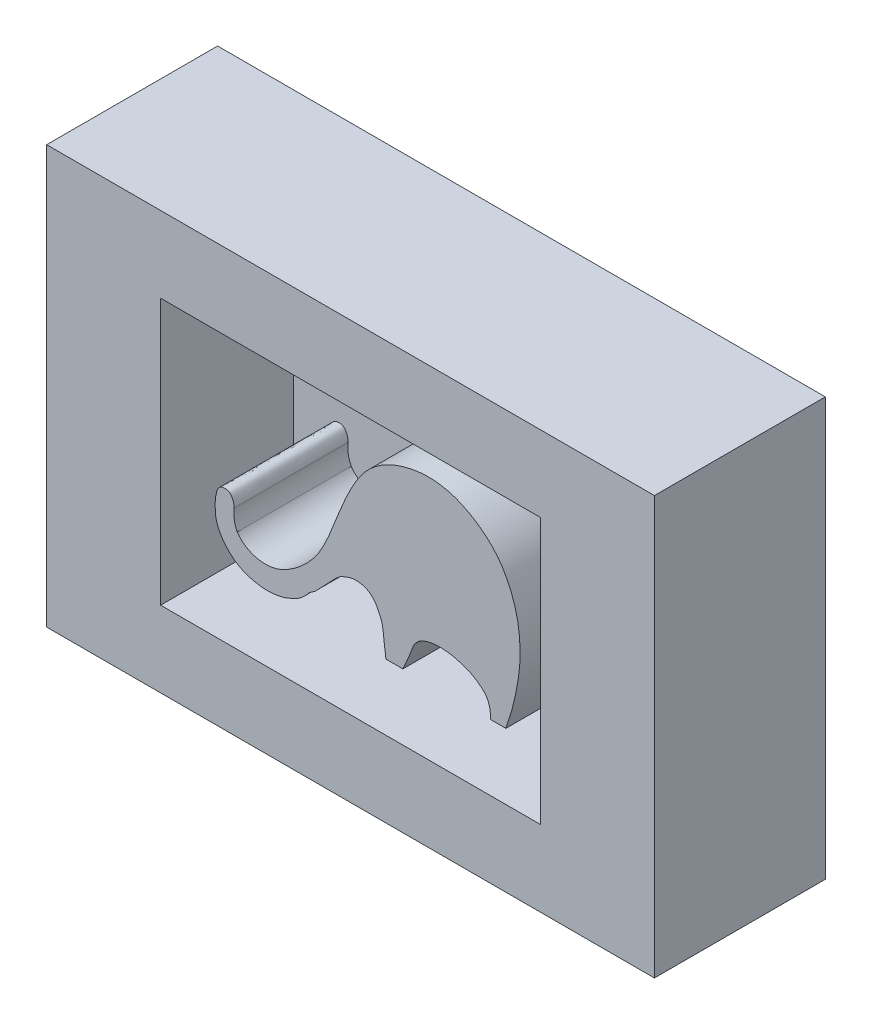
ISO-10303-21;
HEADER;
FILE_DESCRIPTION(('STEP AP214'),'2;1');
FILE_NAME('part.step','',(''),(''),'','','');
FILE_SCHEMA(('AUTOMOTIVE_DESIGN { 1 0 10303 214 1 1 1 1 }'));
ENDSEC;
DATA;
#1=APPLICATION_CONTEXT('core data for automotive mechanical design processes');
#2=APPLICATION_PROTOCOL_DEFINITION('international standard','automotive_design',2000,#1);
#3=PRODUCT_CONTEXT('',#1,'mechanical');
#4=PRODUCT('Part','Part','',(#3));
#5=PRODUCT_RELATED_PRODUCT_CATEGORY('part','',(#4));
#6=PRODUCT_DEFINITION_FORMATION('','',#4);
#7=PRODUCT_DEFINITION_CONTEXT('part definition',#1,'design');
#8=PRODUCT_DEFINITION('design','',#6,#7);
#9=PRODUCT_DEFINITION_SHAPE('','',#8);
#10=(LENGTH_UNIT() NAMED_UNIT(*) SI_UNIT(.MILLI.,.METRE.));
#11=(NAMED_UNIT(*) PLANE_ANGLE_UNIT() SI_UNIT($,.RADIAN.));
#12=(NAMED_UNIT(*) SI_UNIT($,.STERADIAN.) SOLID_ANGLE_UNIT());
#13=UNCERTAINTY_MEASURE_WITH_UNIT(LENGTH_MEASURE(1.E-05),#10,'distance_accuracy_value','');
#14=(GEOMETRIC_REPRESENTATION_CONTEXT(3) GLOBAL_UNCERTAINTY_ASSIGNED_CONTEXT((#13)) GLOBAL_UNIT_ASSIGNED_CONTEXT((#10,
#11,#12)) REPRESENTATION_CONTEXT('',''));
#15=CARTESIAN_POINT('',(0.,0.,0.));
#16=DIRECTION('',(0.,0.,1.));
#17=DIRECTION('',(1.,0.,0.));
#18=AXIS2_PLACEMENT_3D('',#15,#16,#17);
#19=CARTESIAN_POINT('',(0.,0.,9.99999999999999));
#20=DIRECTION('',(0.,0.,-1.));
#21=DIRECTION('',(-1.,0.,0.));
#22=AXIS2_PLACEMENT_3D('',#19,#20,#21);
#23=PLANE('',#22);
#24=DIRECTION('',(0.,1.,0.));
#25=VECTOR('',#24,1.);
#26=CARTESIAN_POINT('',(50.,-35.,9.99999999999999));
#27=LINE('',#26,#25);
#28=CARTESIAN_POINT('',(50.,-35.,9.99999999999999));
#29=VERTEX_POINT('',#28);
#30=CARTESIAN_POINT('',(50.,35.,9.99999999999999));
#31=VERTEX_POINT('',#30);
#32=EDGE_CURVE('E177',#29,#31,#27,.T.);
#33=ORIENTED_EDGE('',*,*,#32,.T.);
#34=DIRECTION('',(-1.,0.,0.));
#35=VECTOR('',#34,1.);
#36=CARTESIAN_POINT('',(-50.,35.,9.99999999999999));
#37=LINE('',#36,#35);
#38=CARTESIAN_POINT('',(-50.,35.,9.99999999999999));
#39=VERTEX_POINT('',#38);
#40=EDGE_CURVE('E180',#31,#39,#37,.T.);
#41=ORIENTED_EDGE('',*,*,#40,.T.);
#42=DIRECTION('',(0.,-1.,0.));
#43=VECTOR('',#42,1.);
#44=CARTESIAN_POINT('',(-50.,-35.,9.99999999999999));
#45=LINE('',#44,#43);
#46=CARTESIAN_POINT('',(-50.,-35.,9.99999999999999));
#47=VERTEX_POINT('',#46);
#48=EDGE_CURVE('E184',#39,#47,#45,.T.);
#49=ORIENTED_EDGE('',*,*,#48,.T.);
#50=DIRECTION('',(1.,0.,0.));
#51=VECTOR('',#50,1.);
#52=CARTESIAN_POINT('',(-50.,-35.,9.99999999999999));
#53=LINE('',#52,#51);
#54=EDGE_CURVE('E187',#47,#29,#53,.T.);
#55=ORIENTED_EDGE('',*,*,#54,.T.);
#56=EDGE_LOOP('',(#33,#41,#49,#55));
#57=FACE_BOUND('',#56,.T.);
#58=CARTESIAN_POINT('',(-34.8252545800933,-13.2227295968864,9.99999999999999));
#59=CARTESIAN_POINT('',(-35.6069413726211,-11.6342772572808,9.99999999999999));
#60=CARTESIAN_POINT('',(-35.8698034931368,-9.93503432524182,9.99999999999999));
#61=CARTESIAN_POINT('',(-35.6138409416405,-8.12500080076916,9.99999999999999));
#62=B_SPLINE_CURVE_WITH_KNOTS('',3,(#58,#59,#60,#61),.UNSPECIFIED.,.F.,.F.,(4,4),
(0.122664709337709,0.566029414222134),.UNSPECIFIED.);
#63=CARTESIAN_POINT('',(-34.8252545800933,-13.2227295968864,9.99999999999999));
#64=VERTEX_POINT('',#63);
#65=CARTESIAN_POINT('',(-35.6138409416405,-8.12500080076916,9.99999999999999));
#66=VERTEX_POINT('',#65);
#67=EDGE_CURVE('E168',#64,#66,#62,.T.);
#68=ORIENTED_EDGE('',*,*,#67,.F.);
#69=CARTESIAN_POINT('',(35.8957458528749,-22.6352268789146,9.99999999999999));
#70=CARTESIAN_POINT('',(36.6368495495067,-20.4079769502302,9.99999999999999));
#71=CARTESIAN_POINT('',(37.9229176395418,-16.5265737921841,9.99999999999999));
#72=CARTESIAN_POINT('',(38.9563024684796,-11.1211026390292,9.99999999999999));
#73=CARTESIAN_POINT('',(39.6893084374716,-6.17493491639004,9.99999999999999));
#74=CARTESIAN_POINT('',(39.6786385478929,-1.60186800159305,9.99999999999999));
#75=CARTESIAN_POINT('',(39.0903081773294,4.05236889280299,9.99999999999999));
#76=CARTESIAN_POINT('',(37.4441834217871,9.37450914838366,9.99999999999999));
#77=CARTESIAN_POINT('',(33.9359579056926,15.7918423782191,9.99999999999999));
#78=CARTESIAN_POINT('',(28.0401296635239,21.1556007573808,9.99999999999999));
#79=CARTESIAN_POINT('',(19.0470165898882,25.0425602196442,9.99999999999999));
#80=CARTESIAN_POINT('',(8.95978672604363,24.2562516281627,9.99999999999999));
#81=CARTESIAN_POINT('',(-0.395722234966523,19.4806970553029,9.99999999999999));
#82=CARTESIAN_POINT('',(-5.96494381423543,10.1931018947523,9.99999999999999));
#83=CARTESIAN_POINT('',(-9.43621996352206,0.919825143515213,9.99999999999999));
#84=CARTESIAN_POINT('',(-13.2098242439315,-7.97413689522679,9.99999999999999));
#85=CARTESIAN_POINT('',(-18.7377315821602,-13.6281424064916,9.99999999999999));
#86=CARTESIAN_POINT('',(-24.7718071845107,-17.0722518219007,9.99999999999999));
#87=CARTESIAN_POINT('',(-30.6265749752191,-16.8623196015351,9.99999999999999));
#88=CARTESIAN_POINT('',(-33.8453408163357,-14.7163227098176,9.99999999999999));
#89=CARTESIAN_POINT('',(-34.8252545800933,-13.2227295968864,9.99999999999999));
#90=B_SPLINE_CURVE_WITH_KNOTS('',3,(#69,#70,#71,#72,#73,#74,#75,#76,#77,#78,#79,#80,#81,#82,#83,
#84,#85,#86,#87,#88,#89),.UNSPECIFIED.,.F.,.F.,(4,1,1,1,1,1,1,1,1,1,1,1,1,1,1,1,1,1,4),
(0.0659112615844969,0.115561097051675,0.152092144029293,0.18209832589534,0.22110546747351,
0.248334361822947,0.302085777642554,0.337487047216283,0.401918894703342,0.466526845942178,
0.539082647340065,0.608583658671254,0.679782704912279,0.760855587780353,0.819739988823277,
0.881556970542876,0.92498383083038,0.96218898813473,1.),.UNSPECIFIED.);
#91=CARTESIAN_POINT('',(35.8957458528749,-22.6352268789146,10.));
#92=VERTEX_POINT('',#91);
#93=EDGE_CURVE('E165',#92,#64,#90,.T.);
#94=ORIENTED_EDGE('',*,*,#93,.F.);
#95=DIRECTION('',(1.,0.,0.));
#96=VECTOR('',#95,1.);
#97=CARTESIAN_POINT('',(35.8957458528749,-22.6352268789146,9.99999999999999));
#98=LINE('',#97,#96);
#99=CARTESIAN_POINT('',(31.7947525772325,-22.6352268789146,9.99999999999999));
#100=VERTEX_POINT('',#99);
#101=EDGE_CURVE('E477',#100,#92,#98,.T.);
#102=ORIENTED_EDGE('',*,*,#101,.F.);
#103=CARTESIAN_POINT('',(8.78074357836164,-22.6352268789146,9.99999999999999));
#104=CARTESIAN_POINT('',(9.06969173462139,-21.9710981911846,9.99999999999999));
#105=CARTESIAN_POINT('',(9.51428766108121,-20.9708557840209,9.99999999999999));
#106=CARTESIAN_POINT('',(10.0886687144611,-19.6408038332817,9.99999999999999));
#107=CARTESIAN_POINT('',(10.8795093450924,-17.9331227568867,9.99999999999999));
#108=CARTESIAN_POINT('',(11.4106972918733,-15.6676004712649,9.99999999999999));
#109=CARTESIAN_POINT('',(13.1420083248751,-13.9880868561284,9.99999999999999));
#110=CARTESIAN_POINT('',(14.921979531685,-13.2455665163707,9.99999999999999));
#111=CARTESIAN_POINT('',(17.2275105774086,-12.7446303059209,9.99999999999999));
#112=CARTESIAN_POINT('',(20.4007251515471,-12.7533727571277,9.99999999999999));
#113=CARTESIAN_POINT('',(23.6100909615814,-13.4861076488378,9.99999999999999));
#114=CARTESIAN_POINT('',(26.4909708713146,-14.4879476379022,9.99999999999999));
#115=CARTESIAN_POINT('',(28.8799307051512,-15.9618061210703,9.99999999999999));
#116=CARTESIAN_POINT('',(31.5549587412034,-18.3228432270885,9.99999999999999));
#117=CARTESIAN_POINT('',(31.9097111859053,-21.1064727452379,9.99999999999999));
#118=CARTESIAN_POINT('',(31.7947525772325,-22.6352268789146,9.99999999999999));
#119=B_SPLINE_CURVE_WITH_KNOTS('',3,(#103,#104,#105,#106,#107,#108,#109,#110,#111,#112,#113,
#114,#115,#116,#117,#118),.UNSPECIFIED.,.F.,.F.,(4,1,1,1,1,1,1,1,1,1,1,1,1,4),(0.,
0.0642524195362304,0.0971507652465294,0.128504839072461,0.231399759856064,0.297965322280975,
0.332509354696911,0.401753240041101,0.505922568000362,0.611055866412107,0.692835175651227,
0.774982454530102,0.859976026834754,1.),.UNSPECIFIED.);
#120=CARTESIAN_POINT('',(8.78074357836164,-22.6352268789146,9.99999999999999));
#121=VERTEX_POINT('',#120);
#122=EDGE_CURVE('E472',#121,#100,#119,.T.);
#123=ORIENTED_EDGE('',*,*,#122,.F.);
#124=DIRECTION('',(1.,0.,0.));
#125=VECTOR('',#124,1.);
#126=CARTESIAN_POINT('',(8.78074357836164,-22.6352268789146,9.99999999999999));
#127=LINE('',#126,#125);
#128=CARTESIAN_POINT('',(4.31274960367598,-22.6352268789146,9.99999999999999));
#129=VERTEX_POINT('',#128);
#130=EDGE_CURVE('E466',#129,#121,#127,.T.);
#131=ORIENTED_EDGE('',*,*,#130,.F.);
#132=CARTESIAN_POINT('',(-17.1134322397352,-18.9279749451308,9.99999999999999));
#133=CARTESIAN_POINT('',(-16.7936045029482,-18.7565682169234,9.99999999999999));
#134=CARTESIAN_POINT('',(-15.8109639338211,-17.2940983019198,9.99999999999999));
#135=CARTESIAN_POINT('',(-14.5887017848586,-16.8319585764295,9.99999999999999));
#136=CARTESIAN_POINT('',(-13.6169213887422,-15.7308251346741,9.99999999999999));
#137=CARTESIAN_POINT('',(-12.8160601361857,-14.9188705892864,9.99999999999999));
#138=CARTESIAN_POINT('',(-11.8331099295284,-13.8675533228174,9.99999999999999));
#139=CARTESIAN_POINT('',(-10.5190472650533,-12.4826511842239,9.99999999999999));
#140=CARTESIAN_POINT('',(-9.32980883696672,-11.2467317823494,9.99999999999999));
#141=CARTESIAN_POINT('',(-8.22836670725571,-10.2182804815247,9.99999999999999));
#142=CARTESIAN_POINT('',(-7.32387493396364,-9.56819392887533,9.99999999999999));
#143=CARTESIAN_POINT('',(-6.28872956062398,-9.2568932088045,9.99999999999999));
#144=CARTESIAN_POINT('',(-5.33294410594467,-8.80053161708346,9.99999999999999));
#145=CARTESIAN_POINT('',(-4.28612684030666,-8.63858756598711,9.99999999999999));
#146=CARTESIAN_POINT('',(-3.02044222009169,-8.57385639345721,9.99999999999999));
#147=CARTESIAN_POINT('',(-1.53428189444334,-8.80356441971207,9.99999999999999));
#148=CARTESIAN_POINT('',(-0.113808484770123,-9.45492471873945,9.99999999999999));
#149=CARTESIAN_POINT('',(0.905921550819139,-10.3775575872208,9.99999999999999));
#150=CARTESIAN_POINT('',(1.73126137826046,-11.3774554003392,9.99999999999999));
#151=CARTESIAN_POINT('',(2.45074835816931,-12.8264869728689,9.99999999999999));
#152=CARTESIAN_POINT('',(3.51304582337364,-15.0268643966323,9.99999999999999));
#153=CARTESIAN_POINT('',(3.71973054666,-18.5033701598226,9.99999999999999));
#154=CARTESIAN_POINT('',(4.15535636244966,-21.1464879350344,9.99999999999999));
#155=CARTESIAN_POINT('',(4.31274960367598,-22.6352268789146,9.99999999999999));
#156=B_SPLINE_CURVE_WITH_KNOTS('',3,(#132,#133,#134,#135,#136,#137,#138,#139,#140,#141,#142,
#143,#144,#145,#146,#147,#148,#149,#150,#151,#152,#153,#154,#155),.UNSPECIFIED.,.F.,.F.,(4,1,1,
1,1,1,1,1,1,1,1,1,1,1,1,1,1,1,1,1,1,4),(0.,0.031125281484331,0.104407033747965,
0.128894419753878,0.15338180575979,0.20247522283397,0.25156863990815,0.316670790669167,
0.348857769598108,0.380530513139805,0.410563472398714,0.440596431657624,0.470558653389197,
0.500209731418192,0.54883903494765,0.597562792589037,0.631216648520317,0.665627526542,
0.707673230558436,0.769118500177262,0.872682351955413,1.),.UNSPECIFIED.);
#157=CARTESIAN_POINT('',(-17.1134322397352,-18.9279749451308,9.99999999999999));
#158=VERTEX_POINT('',#157);
#159=EDGE_CURVE('E458',#158,#129,#156,.T.);
#160=ORIENTED_EDGE('',*,*,#159,.F.);
#161=CARTESIAN_POINT('',(-40.2522537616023,-6.96923324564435,9.99999999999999));
#162=CARTESIAN_POINT('',(-40.3401333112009,-7.28549587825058,9.99999999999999));
#163=CARTESIAN_POINT('',(-40.5463462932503,-7.82524127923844,9.99999999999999));
#164=CARTESIAN_POINT('',(-40.5556901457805,-8.81956980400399,9.99999999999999));
#165=CARTESIAN_POINT('',(-40.7050498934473,-9.70073239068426,9.99999999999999));
#166=CARTESIAN_POINT('',(-40.5931776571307,-10.9394339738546,9.99999999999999));
#167=CARTESIAN_POINT('',(-40.5824770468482,-12.4453311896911,9.99999999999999));
#168=CARTESIAN_POINT('',(-40.0840444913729,-14.2759894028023,9.99999999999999));
#169=CARTESIAN_POINT('',(-39.2294984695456,-15.9504496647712,9.99999999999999));
#170=CARTESIAN_POINT('',(-38.228237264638,-17.4414001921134,9.99999999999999));
#171=CARTESIAN_POINT('',(-37.028952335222,-18.7960650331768,9.99999999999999));
#172=CARTESIAN_POINT('',(-35.6698273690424,-19.9671387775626,9.99999999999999));
#173=CARTESIAN_POINT('',(-34.2074672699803,-20.8747896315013,9.99999999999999));
#174=CARTESIAN_POINT('',(-32.5879489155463,-21.6726544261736,9.99999999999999));
#175=CARTESIAN_POINT('',(-30.2773843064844,-22.2932485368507,9.99999999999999));
#176=CARTESIAN_POINT('',(-27.866345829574,-22.673827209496,9.99999999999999));
#177=CARTESIAN_POINT('',(-25.5578013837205,-22.5962461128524,9.99999999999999));
#178=CARTESIAN_POINT('',(-23.8724650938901,-22.3464935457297,9.99999999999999));
#179=CARTESIAN_POINT('',(-22.4436939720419,-22.0253397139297,9.99999999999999));
#180=CARTESIAN_POINT('',(-21.3303519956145,-21.5486621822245,9.99999999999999));
#181=CARTESIAN_POINT('',(-19.4586097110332,-20.8700078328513,9.99999999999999));
#182=CARTESIAN_POINT('',(-18.0353120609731,-19.9191849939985,9.99999999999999));
#183=CARTESIAN_POINT('',(-17.1134322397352,-18.9279749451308,9.99999999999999));
#184=B_SPLINE_CURVE_WITH_KNOTS('',3,(#161,#162,#163,#164,#165,#166,#167,#168,#169,#170,#171,
#172,#173,#174,#175,#176,#177,#178,#179,#180,#181,#182,#183),.UNSPECIFIED.,.F.,.F.,(4,1,1,1,1,1,
1,1,1,1,1,1,1,1,1,1,1,1,1,1,4),(0.,0.0215459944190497,0.0376986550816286,0.0651010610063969,
0.0801603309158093,0.119497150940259,0.164246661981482,0.203681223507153,0.24319341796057,
0.282443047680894,0.322734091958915,0.361081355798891,0.395761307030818,0.441431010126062,
0.518356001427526,0.555832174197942,0.593351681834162,0.630762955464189,0.651949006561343,
0.673135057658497,0.762140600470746),.UNSPECIFIED.);
#185=CARTESIAN_POINT('',(-40.2522537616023,-6.96923324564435,9.99999999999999));
#186=VERTEX_POINT('',#185);
#187=EDGE_CURVE('E55',#186,#158,#184,.T.);
#188=ORIENTED_EDGE('',*,*,#187,.F.);
#189=CARTESIAN_POINT('',(-35.6138409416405,-8.12500080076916,9.99999999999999));
#190=CARTESIAN_POINT('',(-35.6545348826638,-7.30153427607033,9.99999999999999));
#191=CARTESIAN_POINT('',(-35.9354173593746,-6.20842070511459,9.99999999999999));
#192=CARTESIAN_POINT('',(-36.90542709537,-5.03371175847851,9.99999999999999));
#193=CARTESIAN_POINT('',(-38.0249863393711,-4.84827722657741,9.99999999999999));
#194=CARTESIAN_POINT('',(-39.5501952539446,-5.06113820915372,9.99999999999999));
#195=CARTESIAN_POINT('',(-40.2328273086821,-6.27105146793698,9.99999999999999));
#196=CARTESIAN_POINT('',(-40.2522537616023,-6.96923324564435,9.99999999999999));
#197=B_SPLINE_CURVE_WITH_KNOTS('',3,(#189,#190,#191,#192,#193,#194,#195,#196),.UNSPECIFIED.,.F.,
.F.,(4,1,1,1,1,4),(0.,0.306186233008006,0.439361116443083,0.549535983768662,0.727048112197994,
1.),.UNSPECIFIED.);
#198=EDGE_CURVE('E50',#66,#186,#197,.T.);
#199=ORIENTED_EDGE('',*,*,#198,.F.);
#200=EDGE_LOOP('',(#68,#94,#102,#123,#131,#160,#188,#199));
#201=FACE_BOUND('',#200,.T.);
#202=ADVANCED_FACE('F35',(#57,#201),#23,.F.);
#203=CARTESIAN_POINT('',(80.,-55.,45.));
#204=DIRECTION('',(-1.,0.,0.));
#205=DIRECTION('',(0.,0.,1.));
#206=AXIS2_PLACEMENT_3D('',#203,#204,#205);
#207=PLANE('',#206);
#208=DIRECTION('',(0.,1.,0.));
#209=VECTOR('',#208,1.);
#210=CARTESIAN_POINT('',(80.,-55.,0.));
#211=LINE('',#210,#209);
#212=CARTESIAN_POINT('',(80.,-55.,0.));
#213=VERTEX_POINT('',#212);
#214=CARTESIAN_POINT('',(80.,55.,0.));
#215=VERTEX_POINT('',#214);
#216=EDGE_CURVE('E200',#213,#215,#211,.T.);
#217=ORIENTED_EDGE('',*,*,#216,.T.);
#218=DIRECTION('',(0.,0.,-1.));
#219=VECTOR('',#218,1.);
#220=CARTESIAN_POINT('',(80.,55.,45.));
#221=LINE('',#220,#219);
#222=CARTESIAN_POINT('',(80.,55.,45.));
#223=VERTEX_POINT('',#222);
#224=EDGE_CURVE('E11',#223,#215,#221,.T.);
#225=ORIENTED_EDGE('',*,*,#224,.F.);
#226=DIRECTION('',(0.,1.,0.));
#227=VECTOR('',#226,1.);
#228=CARTESIAN_POINT('',(80.,-55.,45.));
#229=LINE('',#228,#227);
#230=CARTESIAN_POINT('',(80.,-55.,45.));
#231=VERTEX_POINT('',#230);
#232=EDGE_CURVE('E207',#231,#223,#229,.T.);
#233=ORIENTED_EDGE('',*,*,#232,.F.);
#234=DIRECTION('',(0.,0.,-1.));
#235=VECTOR('',#234,1.);
#236=CARTESIAN_POINT('',(80.,-55.,45.));
#237=LINE('',#236,#235);
#238=EDGE_CURVE('E217',#231,#213,#237,.T.);
#239=ORIENTED_EDGE('',*,*,#238,.T.);
#240=EDGE_LOOP('',(#217,#225,#233,#239));
#241=FACE_BOUND('',#240,.T.);
#242=ADVANCED_FACE('F37',(#241),#207,.F.);
#243=CARTESIAN_POINT('',(-80.,55.,45.));
#244=DIRECTION('',(0.,-1.,0.));
#245=DIRECTION('',(0.,0.,-1.));
#246=AXIS2_PLACEMENT_3D('',#243,#244,#245);
#247=PLANE('',#246);
#248=DIRECTION('',(-1.,0.,0.));
#249=VECTOR('',#248,1.);
#250=CARTESIAN_POINT('',(-80.,55.,0.));
#251=LINE('',#250,#249);
#252=CARTESIAN_POINT('',(-80.,55.,0.));
#253=VERTEX_POINT('',#252);
#254=EDGE_CURVE('E220',#215,#253,#251,.T.);
#255=ORIENTED_EDGE('',*,*,#254,.T.);
#256=DIRECTION('',(0.,0.,-1.));
#257=VECTOR('',#256,1.);
#258=CARTESIAN_POINT('',(-80.,55.,45.));
#259=LINE('',#258,#257);
#260=CARTESIAN_POINT('',(-80.,55.,45.));
#261=VERTEX_POINT('',#260);
#262=EDGE_CURVE('E43',#261,#253,#259,.T.);
#263=ORIENTED_EDGE('',*,*,#262,.F.);
#264=DIRECTION('',(-1.,0.,0.));
#265=VECTOR('',#264,1.);
#266=CARTESIAN_POINT('',(-80.,55.,45.));
#267=LINE('',#266,#265);
#268=EDGE_CURVE('E210',#223,#261,#267,.T.);
#269=ORIENTED_EDGE('',*,*,#268,.F.);
#270=ORIENTED_EDGE('',*,*,#224,.T.);
#271=EDGE_LOOP('',(#255,#263,#269,#270));
#272=FACE_BOUND('',#271,.T.);
#273=ADVANCED_FACE('F250',(#272),#247,.F.);
#274=CARTESIAN_POINT('',(-80.,-55.,45.));
#275=DIRECTION('',(1.,0.,0.));
#276=DIRECTION('',(0.,0.,-1.));
#277=AXIS2_PLACEMENT_3D('',#274,#275,#276);
#278=PLANE('',#277);
#279=DIRECTION('',(0.,-1.,0.));
#280=VECTOR('',#279,1.);
#281=CARTESIAN_POINT('',(-80.,-55.,0.));
#282=LINE('',#281,#280);
#283=CARTESIAN_POINT('',(-80.,-55.,0.));
#284=VERTEX_POINT('',#283);
#285=EDGE_CURVE('E222',#253,#284,#282,.T.);
#286=ORIENTED_EDGE('',*,*,#285,.T.);
#287=DIRECTION('',(0.,0.,-1.));
#288=VECTOR('',#287,1.);
#289=CARTESIAN_POINT('',(-80.,-55.,45.));
#290=LINE('',#289,#288);
#291=CARTESIAN_POINT('',(-80.,-55.,45.));
#292=VERTEX_POINT('',#291);
#293=EDGE_CURVE('E227',#292,#284,#290,.T.);
#294=ORIENTED_EDGE('',*,*,#293,.F.);
#295=DIRECTION('',(0.,-1.,0.));
#296=VECTOR('',#295,1.);
#297=CARTESIAN_POINT('',(-80.,-55.,45.));
#298=LINE('',#297,#296);
#299=EDGE_CURVE('E213',#261,#292,#298,.T.);
#300=ORIENTED_EDGE('',*,*,#299,.F.);
#301=ORIENTED_EDGE('',*,*,#262,.T.);
#302=EDGE_LOOP('',(#286,#294,#300,#301));
#303=FACE_BOUND('',#302,.T.);
#304=ADVANCED_FACE('F234',(#303),#278,.F.);
#305=CARTESIAN_POINT('',(-80.,-55.,45.));
#306=DIRECTION('',(0.,1.,0.));
#307=DIRECTION('',(0.,0.,1.));
#308=AXIS2_PLACEMENT_3D('',#305,#306,#307);
#309=PLANE('',#308);
#310=DIRECTION('',(1.,0.,0.));
#311=VECTOR('',#310,1.);
#312=CARTESIAN_POINT('',(-80.,-55.,0.));
#313=LINE('',#312,#311);
#314=EDGE_CURVE('E211',#284,#213,#313,.T.);
#315=ORIENTED_EDGE('',*,*,#314,.T.);
#316=ORIENTED_EDGE('',*,*,#238,.F.);
#317=DIRECTION('',(1.,0.,0.));
#318=VECTOR('',#317,1.);
#319=CARTESIAN_POINT('',(-80.,-55.,45.));
#320=LINE('',#319,#318);
#321=EDGE_CURVE('E215',#292,#231,#320,.T.);
#322=ORIENTED_EDGE('',*,*,#321,.F.);
#323=ORIENTED_EDGE('',*,*,#293,.T.);
#324=EDGE_LOOP('',(#315,#316,#322,#323));
#325=FACE_BOUND('',#324,.T.);
#326=ADVANCED_FACE('F243',(#325),#309,.F.);
#327=CARTESIAN_POINT('',(0.,0.,45.));
#328=DIRECTION('',(0.,0.,-1.));
#329=DIRECTION('',(-1.,0.,0.));
#330=AXIS2_PLACEMENT_3D('',#327,#328,#329);
#331=PLANE('',#330);
#332=DIRECTION('',(-1.,0.,0.));
#333=VECTOR('',#332,1.);
#334=CARTESIAN_POINT('',(-50.,35.,45.));
#335=LINE('',#334,#333);
#336=CARTESIAN_POINT('',(50.,35.,45.));
#337=VERTEX_POINT('',#336);
#338=CARTESIAN_POINT('',(-50.,35.,45.));
#339=VERTEX_POINT('',#338);
#340=EDGE_CURVE('E171',#337,#339,#335,.T.);
#341=ORIENTED_EDGE('',*,*,#340,.F.);
#342=DIRECTION('',(0.,1.,0.));
#343=VECTOR('',#342,1.);
#344=CARTESIAN_POINT('',(50.,-35.,45.));
#345=LINE('',#344,#343);
#346=CARTESIAN_POINT('',(50.,-35.,45.));
#347=VERTEX_POINT('',#346);
#348=EDGE_CURVE('E169',#347,#337,#345,.T.);
#349=ORIENTED_EDGE('',*,*,#348,.F.);
#350=DIRECTION('',(1.,0.,0.));
#351=VECTOR('',#350,1.);
#352=CARTESIAN_POINT('',(-50.,-35.,45.));
#353=LINE('',#352,#351);
#354=CARTESIAN_POINT('',(-50.,-35.,45.));
#355=VERTEX_POINT('',#354);
#356=EDGE_CURVE('E181',#355,#347,#353,.T.);
#357=ORIENTED_EDGE('',*,*,#356,.F.);
#358=DIRECTION('',(0.,-1.,0.));
#359=VECTOR('',#358,1.);
#360=CARTESIAN_POINT('',(-50.,-35.,45.));
#361=LINE('',#360,#359);
#362=EDGE_CURVE('E193',#339,#355,#361,.T.);
#363=ORIENTED_EDGE('',*,*,#362,.F.);
#364=EDGE_LOOP('',(#341,#349,#357,#363));
#365=FACE_BOUND('',#364,.T.);
#366=ORIENTED_EDGE('',*,*,#232,.T.);
#367=ORIENTED_EDGE('',*,*,#268,.T.);
#368=ORIENTED_EDGE('',*,*,#299,.T.);
#369=ORIENTED_EDGE('',*,*,#321,.T.);
#370=EDGE_LOOP('',(#366,#367,#368,#369));
#371=FACE_BOUND('',#370,.T.);
#372=ADVANCED_FACE('F249',(#365,#371),#331,.F.);
#373=CARTESIAN_POINT('',(0.,0.,0.));
#374=DIRECTION('',(0.,0.,-1.));
#375=DIRECTION('',(-1.,0.,0.));
#376=AXIS2_PLACEMENT_3D('',#373,#374,#375);
#377=PLANE('',#376);
#378=ORIENTED_EDGE('',*,*,#216,.F.);
#379=ORIENTED_EDGE('',*,*,#314,.F.);
#380=ORIENTED_EDGE('',*,*,#285,.F.);
#381=ORIENTED_EDGE('',*,*,#254,.F.);
#382=EDGE_LOOP('',(#378,#379,#380,#381));
#383=FACE_BOUND('',#382,.T.);
#384=ADVANCED_FACE('F240',(#383),#377,.T.);
#385=CARTESIAN_POINT('',(50.,-35.,9.99999999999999));
#386=DIRECTION('',(1.,0.,0.));
#387=DIRECTION('',(0.,0.,-1.));
#388=AXIS2_PLACEMENT_3D('',#385,#386,#387);
#389=PLANE('',#388);
#390=ORIENTED_EDGE('',*,*,#348,.T.);
#391=DIRECTION('',(0.,0.,1.));
#392=VECTOR('',#391,1.);
#393=CARTESIAN_POINT('',(50.,35.,9.99999999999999));
#394=LINE('',#393,#392);
#395=EDGE_CURVE('E189',#31,#337,#394,.T.);
#396=ORIENTED_EDGE('',*,*,#395,.F.);
#397=ORIENTED_EDGE('',*,*,#32,.F.);
#398=DIRECTION('',(0.,0.,1.));
#399=VECTOR('',#398,1.);
#400=CARTESIAN_POINT('',(50.,-35.,9.99999999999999));
#401=LINE('',#400,#399);
#402=EDGE_CURVE('E198',#29,#347,#401,.T.);
#403=ORIENTED_EDGE('',*,*,#402,.T.);
#404=EDGE_LOOP('',(#390,#396,#397,#403));
#405=FACE_BOUND('',#404,.T.);
#406=ADVANCED_FACE('F269',(#405),#389,.F.);
#407=CARTESIAN_POINT('',(-50.,-35.,9.99999999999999));
#408=DIRECTION('',(0.,-1.,0.));
#409=DIRECTION('',(0.,0.,-1.));
#410=AXIS2_PLACEMENT_3D('',#407,#408,#409);
#411=PLANE('',#410);
#412=ORIENTED_EDGE('',*,*,#356,.T.);
#413=ORIENTED_EDGE('',*,*,#402,.F.);
#414=ORIENTED_EDGE('',*,*,#54,.F.);
#415=DIRECTION('',(0.,0.,1.));
#416=VECTOR('',#415,1.);
#417=CARTESIAN_POINT('',(-50.,-35.,9.99999999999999));
#418=LINE('',#417,#416);
#419=EDGE_CURVE('E201',#47,#355,#418,.T.);
#420=ORIENTED_EDGE('',*,*,#419,.T.);
#421=EDGE_LOOP('',(#412,#413,#414,#420));
#422=FACE_BOUND('',#421,.T.);
#423=ADVANCED_FACE('F265',(#422),#411,.F.);
#424=CARTESIAN_POINT('',(-50.,-35.,9.99999999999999));
#425=DIRECTION('',(-1.,0.,0.));
#426=DIRECTION('',(0.,0.,1.));
#427=AXIS2_PLACEMENT_3D('',#424,#425,#426);
#428=PLANE('',#427);
#429=ORIENTED_EDGE('',*,*,#362,.T.);
#430=ORIENTED_EDGE('',*,*,#419,.F.);
#431=ORIENTED_EDGE('',*,*,#48,.F.);
#432=DIRECTION('',(0.,0.,1.));
#433=VECTOR('',#432,1.);
#434=CARTESIAN_POINT('',(-50.,35.,9.99999999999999));
#435=LINE('',#434,#433);
#436=EDGE_CURVE('E203',#39,#339,#435,.T.);
#437=ORIENTED_EDGE('',*,*,#436,.T.);
#438=EDGE_LOOP('',(#429,#430,#431,#437));
#439=FACE_BOUND('',#438,.T.);
#440=ADVANCED_FACE('F268',(#439),#428,.F.);
#441=CARTESIAN_POINT('',(-50.,35.,9.99999999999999));
#442=DIRECTION('',(0.,1.,0.));
#443=DIRECTION('',(0.,0.,1.));
#444=AXIS2_PLACEMENT_3D('',#441,#442,#443);
#445=PLANE('',#444);
#446=ORIENTED_EDGE('',*,*,#340,.T.);
#447=ORIENTED_EDGE('',*,*,#436,.F.);
#448=ORIENTED_EDGE('',*,*,#40,.F.);
#449=ORIENTED_EDGE('',*,*,#395,.T.);
#450=EDGE_LOOP('',(#446,#447,#448,#449));
#451=FACE_BOUND('',#450,.T.);
#452=ADVANCED_FACE('F273',(#451),#445,.F.);
#453=CARTESIAN_POINT('',(-34.8252545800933,-13.2227295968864,40.));
#454=CARTESIAN_POINT('',(-35.6069413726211,-11.6342772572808,40.));
#455=CARTESIAN_POINT('',(-35.8698034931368,-9.93503432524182,40.));
#456=CARTESIAN_POINT('',(-35.6138409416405,-8.12500080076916,40.));
#457=B_SPLINE_CURVE_WITH_KNOTS('',3,(#453,#454,#455,#456),.UNSPECIFIED.,.F.,.F.,(4,4),
(0.122664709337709,0.566029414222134),.UNSPECIFIED.);
#458=DIRECTION('',(0.,0.,-1.));
#459=VECTOR('',#458,1.);
#460=SURFACE_OF_LINEAR_EXTRUSION('',#457,#459);
#461=ORIENTED_EDGE('',*,*,#67,.T.);
#462=DIRECTION('',(0.,0.,-1.));
#463=VECTOR('',#462,1.);
#464=CARTESIAN_POINT('',(-35.6138409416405,-8.12500080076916,40.));
#465=LINE('',#464,#463);
#466=CARTESIAN_POINT('',(-35.6138409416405,-8.12500080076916,40.));
#467=VERTEX_POINT('',#466);
#468=EDGE_CURVE('E149',#467,#66,#465,.T.);
#469=ORIENTED_EDGE('',*,*,#468,.F.);
#470=CARTESIAN_POINT('',(-34.8252545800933,-13.2227295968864,40.));
#471=VERTEX_POINT('',#470);
#472=EDGE_CURVE('E156',#471,#467,#457,.T.);
#473=ORIENTED_EDGE('',*,*,#472,.F.);
#474=DIRECTION('',(0.,0.,-1.));
#475=VECTOR('',#474,1.);
#476=CARTESIAN_POINT('',(-34.8252545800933,-13.2227295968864,40.));
#477=LINE('',#476,#475);
#478=EDGE_CURVE('E437',#471,#64,#477,.T.);
#479=ORIENTED_EDGE('',*,*,#478,.T.);
#480=EDGE_LOOP('',(#461,#469,#473,#479));
#481=FACE_BOUND('',#480,.T.);
#482=ADVANCED_FACE('F167',(#481),#460,.F.);
#483=CARTESIAN_POINT('',(-35.6138409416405,-8.12500080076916,40.));
#484=CARTESIAN_POINT('',(-35.6545348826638,-7.30153427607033,40.));
#485=CARTESIAN_POINT('',(-35.9354173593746,-6.20842070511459,40.));
#486=CARTESIAN_POINT('',(-36.90542709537,-5.03371175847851,40.));
#487=CARTESIAN_POINT('',(-38.0249863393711,-4.84827722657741,40.));
#488=CARTESIAN_POINT('',(-39.5501952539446,-5.06113820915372,40.));
#489=CARTESIAN_POINT('',(-40.2328273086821,-6.27105146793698,40.));
#490=CARTESIAN_POINT('',(-40.2522537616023,-6.96923324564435,40.));
#491=B_SPLINE_CURVE_WITH_KNOTS('',3,(#483,#484,#485,#486,#487,#488,#489,#490),.UNSPECIFIED.,.F.,
.F.,(4,1,1,1,1,4),(0.,0.306186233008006,0.439361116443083,0.549535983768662,0.727048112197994,
1.),.UNSPECIFIED.);
#492=DIRECTION('',(0.,0.,-1.));
#493=VECTOR('',#492,1.);
#494=SURFACE_OF_LINEAR_EXTRUSION('',#491,#493);
#495=ORIENTED_EDGE('',*,*,#198,.T.);
#496=DIRECTION('',(0.,0.,-1.));
#497=VECTOR('',#496,1.);
#498=CARTESIAN_POINT('',(-40.2522537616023,-6.96923324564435,40.));
#499=LINE('',#498,#497);
#500=CARTESIAN_POINT('',(-40.2522537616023,-6.96923324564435,40.));
#501=VERTEX_POINT('',#500);
#502=EDGE_CURVE('E152',#501,#186,#499,.T.);
#503=ORIENTED_EDGE('',*,*,#502,.F.);
#504=EDGE_CURVE('E145',#467,#501,#491,.T.);
#505=ORIENTED_EDGE('',*,*,#504,.F.);
#506=ORIENTED_EDGE('',*,*,#468,.T.);
#507=EDGE_LOOP('',(#495,#503,#505,#506));
#508=FACE_BOUND('',#507,.T.);
#509=ADVANCED_FACE('F147',(#508),#494,.F.);
#510=CARTESIAN_POINT('',(-40.2522537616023,-6.96923324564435,40.));
#511=CARTESIAN_POINT('',(-40.3401333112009,-7.28549587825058,40.));
#512=CARTESIAN_POINT('',(-40.5463462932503,-7.82524127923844,40.));
#513=CARTESIAN_POINT('',(-40.5556901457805,-8.81956980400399,40.));
#514=CARTESIAN_POINT('',(-40.7050498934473,-9.70073239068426,40.));
#515=CARTESIAN_POINT('',(-40.5931776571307,-10.9394339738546,40.));
#516=CARTESIAN_POINT('',(-40.5824770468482,-12.4453311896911,40.));
#517=CARTESIAN_POINT('',(-40.0840444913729,-14.2759894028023,40.));
#518=CARTESIAN_POINT('',(-39.2294984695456,-15.9504496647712,40.));
#519=CARTESIAN_POINT('',(-38.228237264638,-17.4414001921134,40.));
#520=CARTESIAN_POINT('',(-37.028952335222,-18.7960650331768,40.));
#521=CARTESIAN_POINT('',(-35.6698273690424,-19.9671387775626,40.));
#522=CARTESIAN_POINT('',(-34.2074672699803,-20.8747896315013,40.));
#523=CARTESIAN_POINT('',(-32.5879489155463,-21.6726544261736,40.));
#524=CARTESIAN_POINT('',(-30.2773843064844,-22.2932485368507,40.));
#525=CARTESIAN_POINT('',(-27.866345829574,-22.673827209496,40.));
#526=CARTESIAN_POINT('',(-25.5578013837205,-22.5962461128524,40.));
#527=CARTESIAN_POINT('',(-23.8724650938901,-22.3464935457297,40.));
#528=CARTESIAN_POINT('',(-22.4436939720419,-22.0253397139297,40.));
#529=CARTESIAN_POINT('',(-21.3303519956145,-21.5486621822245,40.));
#530=CARTESIAN_POINT('',(-19.4586097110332,-20.8700078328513,40.));
#531=CARTESIAN_POINT('',(-18.0353120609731,-19.9191849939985,40.));
#532=CARTESIAN_POINT('',(-17.1134322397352,-18.9279749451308,40.));
#533=B_SPLINE_CURVE_WITH_KNOTS('',3,(#510,#511,#512,#513,#514,#515,#516,#517,#518,#519,#520,
#521,#522,#523,#524,#525,#526,#527,#528,#529,#530,#531,#532),.UNSPECIFIED.,.F.,.F.,(4,1,1,1,1,1,
1,1,1,1,1,1,1,1,1,1,1,1,1,1,4),(0.,0.0215459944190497,0.0376986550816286,0.0651010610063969,
0.0801603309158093,0.119497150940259,0.164246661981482,0.203681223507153,0.24319341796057,
0.282443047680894,0.322734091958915,0.361081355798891,0.395761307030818,0.441431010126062,
0.518356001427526,0.555832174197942,0.593351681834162,0.630762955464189,0.651949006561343,
0.673135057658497,0.762140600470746),.UNSPECIFIED.);
#534=DIRECTION('',(0.,0.,-1.));
#535=VECTOR('',#534,1.);
#536=SURFACE_OF_LINEAR_EXTRUSION('',#533,#535);
#537=ORIENTED_EDGE('',*,*,#187,.T.);
#538=DIRECTION('',(0.,0.,-1.));
#539=VECTOR('',#538,1.);
#540=CARTESIAN_POINT('',(-17.1134322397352,-18.9279749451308,40.));
#541=LINE('',#540,#539);
#542=CARTESIAN_POINT('',(-17.1134322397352,-18.9279749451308,40.));
#543=VERTEX_POINT('',#542);
#544=EDGE_CURVE('E173',#543,#158,#541,.T.);
#545=ORIENTED_EDGE('',*,*,#544,.F.);
#546=EDGE_CURVE('E155',#501,#543,#533,.T.);
#547=ORIENTED_EDGE('',*,*,#546,.F.);
#548=ORIENTED_EDGE('',*,*,#502,.T.);
#549=EDGE_LOOP('',(#537,#545,#547,#548));
#550=FACE_BOUND('',#549,.T.);
#551=ADVANCED_FACE('F326',(#550),#536,.F.);
#552=CARTESIAN_POINT('',(-17.1134322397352,-18.9279749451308,40.));
#553=CARTESIAN_POINT('',(-16.7936045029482,-18.7565682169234,40.));
#554=CARTESIAN_POINT('',(-15.8109639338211,-17.2940983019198,40.));
#555=CARTESIAN_POINT('',(-14.5887017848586,-16.8319585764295,40.));
#556=CARTESIAN_POINT('',(-13.6169213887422,-15.7308251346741,40.));
#557=CARTESIAN_POINT('',(-12.8160601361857,-14.9188705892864,40.));
#558=CARTESIAN_POINT('',(-11.8331099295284,-13.8675533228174,40.));
#559=CARTESIAN_POINT('',(-10.5190472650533,-12.4826511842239,40.));
#560=CARTESIAN_POINT('',(-9.32980883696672,-11.2467317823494,40.));
#561=CARTESIAN_POINT('',(-8.22836670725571,-10.2182804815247,40.));
#562=CARTESIAN_POINT('',(-7.32387493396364,-9.56819392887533,40.));
#563=CARTESIAN_POINT('',(-6.28872956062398,-9.2568932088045,40.));
#564=CARTESIAN_POINT('',(-5.33294410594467,-8.80053161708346,40.));
#565=CARTESIAN_POINT('',(-4.28612684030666,-8.63858756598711,40.));
#566=CARTESIAN_POINT('',(-3.02044222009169,-8.57385639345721,40.));
#567=CARTESIAN_POINT('',(-1.53428189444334,-8.80356441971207,40.));
#568=CARTESIAN_POINT('',(-0.113808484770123,-9.45492471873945,40.));
#569=CARTESIAN_POINT('',(0.905921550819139,-10.3775575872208,40.));
#570=CARTESIAN_POINT('',(1.73126137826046,-11.3774554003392,40.));
#571=CARTESIAN_POINT('',(2.45074835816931,-12.8264869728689,40.));
#572=CARTESIAN_POINT('',(3.51304582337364,-15.0268643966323,40.));
#573=CARTESIAN_POINT('',(3.71973054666,-18.5033701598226,40.));
#574=CARTESIAN_POINT('',(4.15535636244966,-21.1464879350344,40.));
#575=CARTESIAN_POINT('',(4.31274960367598,-22.6352268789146,40.));
#576=B_SPLINE_CURVE_WITH_KNOTS('',3,(#552,#553,#554,#555,#556,#557,#558,#559,#560,#561,#562,
#563,#564,#565,#566,#567,#568,#569,#570,#571,#572,#573,#574,#575),.UNSPECIFIED.,.F.,.F.,(4,1,1,
1,1,1,1,1,1,1,1,1,1,1,1,1,1,1,1,1,1,4),(0.,0.031125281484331,0.104407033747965,
0.128894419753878,0.15338180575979,0.20247522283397,0.25156863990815,0.316670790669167,
0.348857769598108,0.380530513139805,0.410563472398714,0.440596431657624,0.470558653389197,
0.500209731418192,0.54883903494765,0.597562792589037,0.631216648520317,0.665627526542,
0.707673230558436,0.769118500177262,0.872682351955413,1.),.UNSPECIFIED.);
#577=DIRECTION('',(0.,0.,-1.));
#578=VECTOR('',#577,1.);
#579=SURFACE_OF_LINEAR_EXTRUSION('',#576,#578);
#580=ORIENTED_EDGE('',*,*,#159,.T.);
#581=DIRECTION('',(0.,0.,-1.));
#582=VECTOR('',#581,1.);
#583=CARTESIAN_POINT('',(4.31274960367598,-22.6352268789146,40.));
#584=LINE('',#583,#582);
#585=CARTESIAN_POINT('',(4.31274960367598,-22.6352268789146,40.));
#586=VERTEX_POINT('',#585);
#587=EDGE_CURVE('E500',#586,#129,#584,.T.);
#588=ORIENTED_EDGE('',*,*,#587,.F.);
#589=EDGE_CURVE('E506',#543,#586,#576,.T.);
#590=ORIENTED_EDGE('',*,*,#589,.F.);
#591=ORIENTED_EDGE('',*,*,#544,.T.);
#592=EDGE_LOOP('',(#580,#588,#590,#591));
#593=FACE_BOUND('',#592,.T.);
#594=ADVANCED_FACE('F332',(#593),#579,.F.);
#595=CARTESIAN_POINT('',(8.78074357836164,-22.6352268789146,40.));
#596=DIRECTION('',(0.,1.,0.));
#597=DIRECTION('',(0.,0.,1.));
#598=AXIS2_PLACEMENT_3D('',#595,#596,#597);
#599=PLANE('',#598);
#600=ORIENTED_EDGE('',*,*,#130,.T.);
#601=DIRECTION('',(0.,0.,-1.));
#602=VECTOR('',#601,1.);
#603=CARTESIAN_POINT('',(8.78074357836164,-22.6352268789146,40.));
#604=LINE('',#603,#602);
#605=CARTESIAN_POINT('',(8.78074357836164,-22.6352268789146,40.));
#606=VERTEX_POINT('',#605);
#607=EDGE_CURVE('E497',#606,#121,#604,.T.);
#608=ORIENTED_EDGE('',*,*,#607,.F.);
#609=DIRECTION('',(1.,0.,0.));
#610=VECTOR('',#609,1.);
#611=CARTESIAN_POINT('',(8.78074357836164,-22.6352268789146,40.));
#612=LINE('',#611,#610);
#613=EDGE_CURVE('E508',#586,#606,#612,.T.);
#614=ORIENTED_EDGE('',*,*,#613,.F.);
#615=ORIENTED_EDGE('',*,*,#587,.T.);
#616=EDGE_LOOP('',(#600,#608,#614,#615));
#617=FACE_BOUND('',#616,.T.);
#618=ADVANCED_FACE('F340',(#617),#599,.F.);
#619=CARTESIAN_POINT('',(8.78074357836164,-22.6352268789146,40.));
#620=CARTESIAN_POINT('',(9.06969173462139,-21.9710981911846,40.));
#621=CARTESIAN_POINT('',(9.51428766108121,-20.9708557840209,40.));
#622=CARTESIAN_POINT('',(10.0886687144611,-19.6408038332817,40.));
#623=CARTESIAN_POINT('',(10.8795093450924,-17.9331227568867,40.));
#624=CARTESIAN_POINT('',(11.4106972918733,-15.6676004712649,40.));
#625=CARTESIAN_POINT('',(13.1420083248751,-13.9880868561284,40.));
#626=CARTESIAN_POINT('',(14.921979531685,-13.2455665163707,40.));
#627=CARTESIAN_POINT('',(17.2275105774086,-12.7446303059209,40.));
#628=CARTESIAN_POINT('',(20.4007251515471,-12.7533727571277,40.));
#629=CARTESIAN_POINT('',(23.6100909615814,-13.4861076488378,40.));
#630=CARTESIAN_POINT('',(26.4909708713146,-14.4879476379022,40.));
#631=CARTESIAN_POINT('',(28.8799307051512,-15.9618061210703,40.));
#632=CARTESIAN_POINT('',(31.5549587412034,-18.3228432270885,40.));
#633=CARTESIAN_POINT('',(31.9097111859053,-21.1064727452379,40.));
#634=CARTESIAN_POINT('',(31.7947525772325,-22.6352268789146,40.));
#635=B_SPLINE_CURVE_WITH_KNOTS('',3,(#619,#620,#621,#622,#623,#624,#625,#626,#627,#628,#629,
#630,#631,#632,#633,#634),.UNSPECIFIED.,.F.,.F.,(4,1,1,1,1,1,1,1,1,1,1,1,1,4),(0.,
0.0642524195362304,0.0971507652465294,0.128504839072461,0.231399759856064,0.297965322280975,
0.332509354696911,0.401753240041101,0.505922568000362,0.611055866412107,0.692835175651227,
0.774982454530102,0.859976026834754,1.),.UNSPECIFIED.);
#636=DIRECTION('',(0.,0.,-1.));
#637=VECTOR('',#636,1.);
#638=SURFACE_OF_LINEAR_EXTRUSION('',#635,#637);
#639=ORIENTED_EDGE('',*,*,#122,.T.);
#640=DIRECTION('',(0.,0.,-1.));
#641=VECTOR('',#640,1.);
#642=CARTESIAN_POINT('',(31.7947525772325,-22.6352268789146,40.));
#643=LINE('',#642,#641);
#644=CARTESIAN_POINT('',(31.7947525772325,-22.6352268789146,40.));
#645=VERTEX_POINT('',#644);
#646=EDGE_CURVE('E494',#645,#100,#643,.T.);
#647=ORIENTED_EDGE('',*,*,#646,.F.);
#648=EDGE_CURVE('E523',#606,#645,#635,.T.);
#649=ORIENTED_EDGE('',*,*,#648,.F.);
#650=ORIENTED_EDGE('',*,*,#607,.T.);
#651=EDGE_LOOP('',(#639,#647,#649,#650));
#652=FACE_BOUND('',#651,.T.);
#653=ADVANCED_FACE('F348',(#652),#638,.F.);
#654=CARTESIAN_POINT('',(35.8957458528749,-22.6352268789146,40.));
#655=DIRECTION('',(0.,1.,0.));
#656=DIRECTION('',(0.,0.,1.));
#657=AXIS2_PLACEMENT_3D('',#654,#655,#656);
#658=PLANE('',#657);
#659=ORIENTED_EDGE('',*,*,#101,.T.);
#660=DIRECTION('',(0.,0.,-1.));
#661=VECTOR('',#660,1.);
#662=CARTESIAN_POINT('',(35.8957458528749,-22.6352268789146,40.));
#663=LINE('',#662,#661);
#664=CARTESIAN_POINT('',(35.8957458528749,-22.6352268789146,40.));
#665=VERTEX_POINT('',#664);
#666=EDGE_CURVE('E491',#665,#92,#663,.T.);
#667=ORIENTED_EDGE('',*,*,#666,.F.);
#668=DIRECTION('',(1.,0.,0.));
#669=VECTOR('',#668,1.);
#670=CARTESIAN_POINT('',(35.8957458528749,-22.6352268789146,40.));
#671=LINE('',#670,#669);
#672=EDGE_CURVE('E438',#645,#665,#671,.T.);
#673=ORIENTED_EDGE('',*,*,#672,.F.);
#674=ORIENTED_EDGE('',*,*,#646,.T.);
#675=EDGE_LOOP('',(#659,#667,#673,#674));
#676=FACE_BOUND('',#675,.T.);
#677=ADVANCED_FACE('F356',(#676),#658,.F.);
#678=CARTESIAN_POINT('',(35.8957458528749,-22.6352268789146,40.));
#679=CARTESIAN_POINT('',(36.6368495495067,-20.4079769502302,40.));
#680=CARTESIAN_POINT('',(37.9229176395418,-16.5265737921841,40.));
#681=CARTESIAN_POINT('',(38.9563024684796,-11.1211026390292,40.));
#682=CARTESIAN_POINT('',(39.6893084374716,-6.17493491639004,40.));
#683=CARTESIAN_POINT('',(39.6786385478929,-1.60186800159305,40.));
#684=CARTESIAN_POINT('',(39.0903081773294,4.05236889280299,40.));
#685=CARTESIAN_POINT('',(37.4441834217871,9.37450914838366,40.));
#686=CARTESIAN_POINT('',(33.9359579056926,15.7918423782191,40.));
#687=CARTESIAN_POINT('',(28.0401296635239,21.1556007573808,40.));
#688=CARTESIAN_POINT('',(19.0470165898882,25.0425602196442,40.));
#689=CARTESIAN_POINT('',(8.95978672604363,24.2562516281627,40.));
#690=CARTESIAN_POINT('',(-0.395722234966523,19.4806970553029,40.));
#691=CARTESIAN_POINT('',(-5.96494381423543,10.1931018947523,40.));
#692=CARTESIAN_POINT('',(-9.43621996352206,0.919825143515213,40.));
#693=CARTESIAN_POINT('',(-13.2098242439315,-7.97413689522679,40.));
#694=CARTESIAN_POINT('',(-18.7377315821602,-13.6281424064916,40.));
#695=CARTESIAN_POINT('',(-24.7718071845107,-17.0722518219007,40.));
#696=CARTESIAN_POINT('',(-30.6265749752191,-16.8623196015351,40.));
#697=CARTESIAN_POINT('',(-33.8453408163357,-14.7163227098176,40.));
#698=CARTESIAN_POINT('',(-34.8252545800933,-13.2227295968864,40.));
#699=B_SPLINE_CURVE_WITH_KNOTS('',3,(#678,#679,#680,#681,#682,#683,#684,#685,#686,#687,#688,
#689,#690,#691,#692,#693,#694,#695,#696,#697,#698),.UNSPECIFIED.,.F.,.F.,(4,1,1,1,1,1,1,1,1,1,1,
1,1,1,1,1,1,1,4),(0.0659112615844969,0.115561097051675,0.152092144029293,0.18209832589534,
0.22110546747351,0.248334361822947,0.302085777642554,0.337487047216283,0.401918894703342,
0.466526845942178,0.539082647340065,0.608583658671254,0.679782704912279,0.760855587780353,
0.819739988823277,0.881556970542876,0.92498383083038,0.96218898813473,1.),.UNSPECIFIED.);
#700=DIRECTION('',(0.,0.,-1.));
#701=VECTOR('',#700,1.);
#702=SURFACE_OF_LINEAR_EXTRUSION('',#699,#701);
#703=ORIENTED_EDGE('',*,*,#93,.T.);
#704=ORIENTED_EDGE('',*,*,#478,.F.);
#705=EDGE_CURVE('E161',#665,#471,#699,.T.);
#706=ORIENTED_EDGE('',*,*,#705,.F.);
#707=ORIENTED_EDGE('',*,*,#666,.T.);
#708=EDGE_LOOP('',(#703,#704,#706,#707));
#709=FACE_BOUND('',#708,.T.);
#710=ADVANCED_FACE('F364',(#709),#702,.F.);
#711=CARTESIAN_POINT('',(-35.6086662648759,-10.7569581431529,40.));
#712=DIRECTION('',(0.,0.,-1.));
#713=DIRECTION('',(-1.,0.,0.));
#714=AXIS2_PLACEMENT_3D('',#711,#712,#713);
#715=PLANE('',#714);
#716=ORIENTED_EDGE('',*,*,#472,.T.);
#717=ORIENTED_EDGE('',*,*,#504,.T.);
#718=ORIENTED_EDGE('',*,*,#546,.T.);
#719=ORIENTED_EDGE('',*,*,#589,.T.);
#720=ORIENTED_EDGE('',*,*,#613,.T.);
#721=ORIENTED_EDGE('',*,*,#648,.T.);
#722=ORIENTED_EDGE('',*,*,#672,.T.);
#723=ORIENTED_EDGE('',*,*,#705,.T.);
#724=EDGE_LOOP('',(#716,#717,#718,#719,#720,#721,#722,#723));
#725=FACE_BOUND('',#724,.T.);
#726=ADVANCED_FACE('F159',(#725),#715,.F.);
#727=CLOSED_SHELL('',(#202,#242,#273,#304,#326,#372,#384,#406,#423,#440,#452,#482,#509,#551,
#594,#618,#653,#677,#710,#726));
#728=MANIFOLD_SOLID_BREP('B2',#727);
#729=ADVANCED_BREP_SHAPE_REPRESENTATION('',(#18,#728),#14);
#730=SHAPE_DEFINITION_REPRESENTATION(#9,#729);
ENDSEC;
END-ISO-10303-21;
